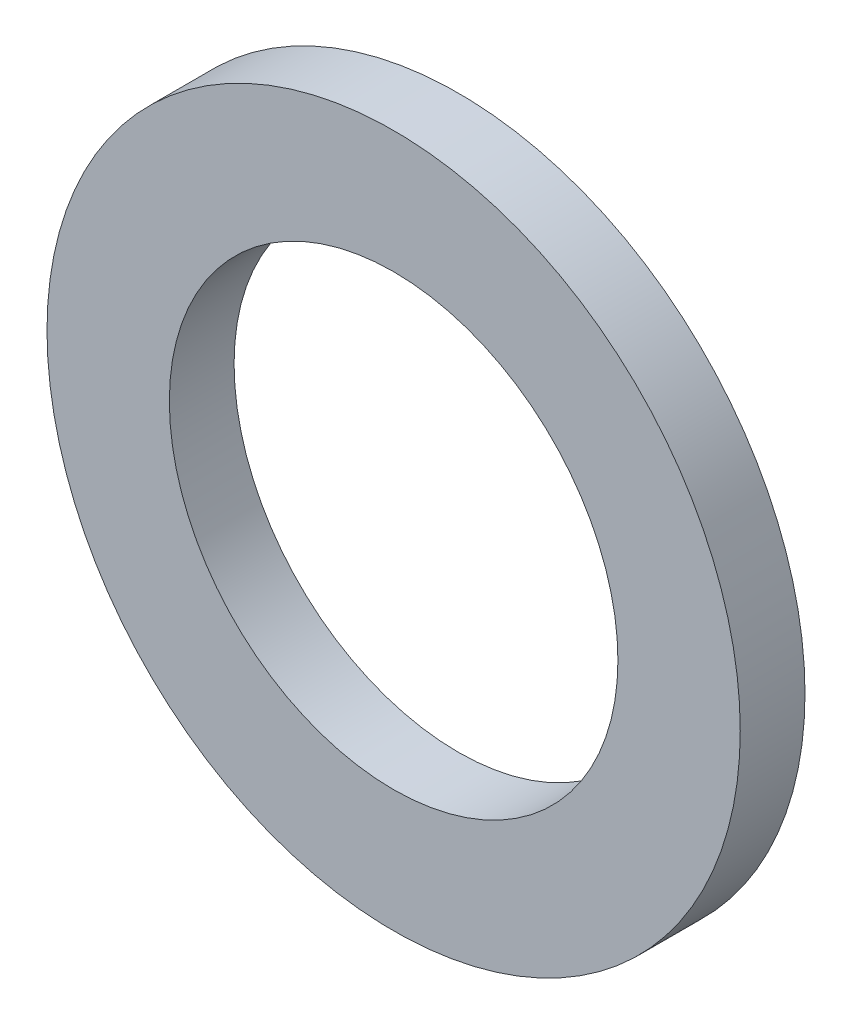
from build123d import *

# Parameters (mm, degrees)
SKETCH1_R           = 17
SKETCH1_R_2         = 11
BOSS_EXTRUDE1_DEPTH = 3.175


with BuildPart() as part:
    # Sketch1 → Boss-Extrude1 (new body)
    with BuildSketch(Plane.XY):
        Circle(SKETCH1_R)
        Circle(SKETCH1_R_2, mode=Mode.SUBTRACT)
    extrude(amount=BOSS_EXTRUDE1_DEPTH)


solid = part.part
